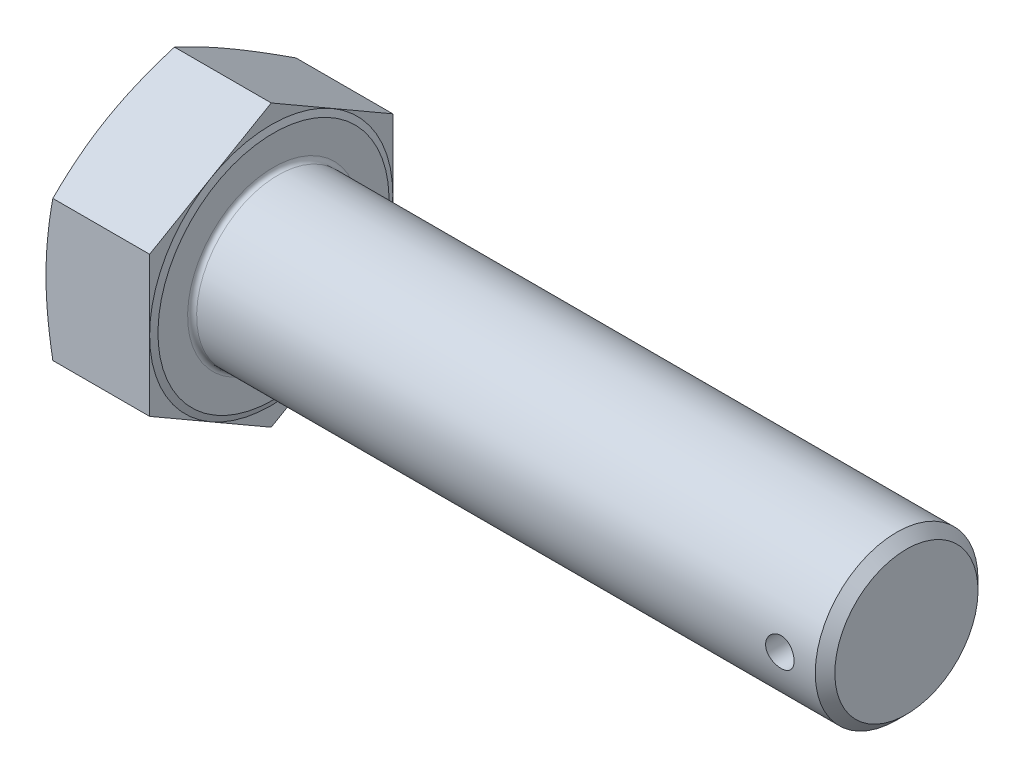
from build123d import *

# Parameters (mm, degrees)
BASEHEAD_DEPTH  = 22.92
SKETCH3_R       = 18
BASEBODY_DEPTH  = 140
CHAMFER1_SIZE   = 2.165
HEADFILLET_R    = 1
HOLE_DEPTH      = 169.506734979
HOLE_DEPTH_BACK = 169.506734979
SKETCH5_R       = 3.15


with BuildPart() as part:
    # Sketch-BaseHead → BaseHead (new body)
    with BuildSketch(Plane(origin=(0, 0, 0), x_dir=(0, 0, -1), z_dir=(1, 0, 0))):
        Polygon((0, -31.061444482), (26.9, -15.530722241), (26.9, 15.530722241), (0, 31.061444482), (-26.9, 15.530722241), (-26.9, -15.530722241), align=None)
    extrude(amount=BASEHEAD_DEPTH)

    # Sketch4 → HeadChamfer (revolve, cut)
    with BuildSketch(Plane(origin=(-0.264637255, -5.916896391, 0), x_dir=(0, 1, 0), z_dir=(0, 0, 1))):
        Polygon((36.978340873, -0.264637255), (32.816896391, -0.264637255), (36.978340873, -1.779279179), align=None)
    revolve(axis=Axis((-4.001564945, 0, 0), (1, 0, 0)), mode=Mode.SUBTRACT)

    # Sketch1 → Revolve1 (revolve)
    with BuildSketch(Plane(origin=(0, 0, 0), x_dir=(1, 0, 0), z_dir=(0, 1, 0)), mode=Mode.PRIVATE) as revolve1_sk:
        Polygon((22.92, 0), (23.42, 0), (23.42, 25.555), (22.92, 26.9), align=None)
    revolve(revolve1_sk.sketch.rotate(Axis((-4.001564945, 0, 0), (1, 0, 0)), 270), axis=Axis((-4.001564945, 0, 0), (1, 0, 0)))

    # Sketch3 → BaseBody (add)
    with BuildSketch(Plane(origin=(23.42, 0, 0), x_dir=(0, 0, -1), z_dir=(1, 0, 0))):
        with Locations(Location((0, 0, 0), (0, 0, 270))):
            Circle(SKETCH3_R)
    extrude(amount=BASEBODY_DEPTH)

    # Chamfer1
    chamfer1_edges = [part.edges().sort_by_distance(p)[0] for p in [
        (163.42, 18, 0),
    ]]
    chamfer(chamfer1_edges, length=CHAMFER1_SIZE)

    # HeadFillet
    headfillet_edges = [part.edges().sort_by_distance(p)[0] for p in [
        (23.42, 18, 0),
    ]]
    fillet(headfillet_edges, radius=HEADFILLET_R)

    # Sketch5 → Hole (cut, two sides: drawn at the far end of the back side and taken through both)
    with BuildSketch(Plane.XY.offset(-HOLE_DEPTH_BACK)):
        with Locations((153.42, 0)):
            Circle(SKETCH5_R)
    extrude(amount=HOLE_DEPTH + HOLE_DEPTH_BACK, mode=Mode.SUBTRACT)


solid = part.part
